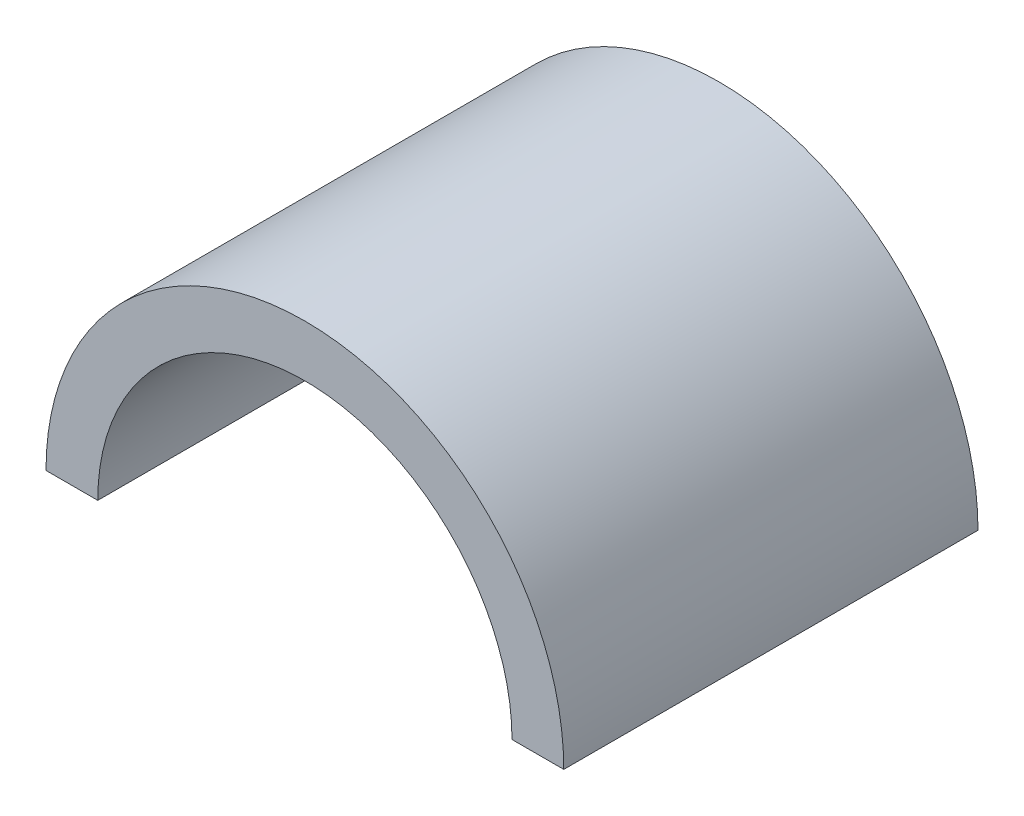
ISO-10303-21;
HEADER;
FILE_DESCRIPTION(('STEP AP214'),'2;1');
FILE_NAME('part.step','',(''),(''),'','','');
FILE_SCHEMA(('AUTOMOTIVE_DESIGN { 1 0 10303 214 1 1 1 1 }'));
ENDSEC;
DATA;
#1=APPLICATION_CONTEXT('core data for automotive mechanical design processes');
#2=APPLICATION_PROTOCOL_DEFINITION('international standard','automotive_design',2000,#1);
#3=PRODUCT_CONTEXT('',#1,'mechanical');
#4=PRODUCT('Part','Part','',(#3));
#5=PRODUCT_RELATED_PRODUCT_CATEGORY('part','',(#4));
#6=PRODUCT_DEFINITION_FORMATION('','',#4);
#7=PRODUCT_DEFINITION_CONTEXT('part definition',#1,'design');
#8=PRODUCT_DEFINITION('design','',#6,#7);
#9=PRODUCT_DEFINITION_SHAPE('','',#8);
#10=(LENGTH_UNIT() NAMED_UNIT(*) SI_UNIT(.MILLI.,.METRE.));
#11=(NAMED_UNIT(*) PLANE_ANGLE_UNIT() SI_UNIT($,.RADIAN.));
#12=(NAMED_UNIT(*) SI_UNIT($,.STERADIAN.) SOLID_ANGLE_UNIT());
#13=UNCERTAINTY_MEASURE_WITH_UNIT(LENGTH_MEASURE(1.E-05),#10,'distance_accuracy_value','');
#14=(GEOMETRIC_REPRESENTATION_CONTEXT(3) GLOBAL_UNCERTAINTY_ASSIGNED_CONTEXT((#13)) GLOBAL_UNIT_ASSIGNED_CONTEXT((#10,
#11,#12)) REPRESENTATION_CONTEXT('',''));
#15=CARTESIAN_POINT('',(0.,0.,0.));
#16=DIRECTION('',(0.,0.,1.));
#17=DIRECTION('',(1.,0.,0.));
#18=AXIS2_PLACEMENT_3D('',#15,#16,#17);
#19=CARTESIAN_POINT('',(0.,0.,40.));
#20=DIRECTION('',(0.,0.,-1.));
#21=DIRECTION('',(-1.,0.,0.));
#22=AXIS2_PLACEMENT_3D('',#19,#20,#21);
#23=CYLINDRICAL_SURFACE('',#22,50.);
#24=CARTESIAN_POINT('',(0.,0.,-40.));
#25=DIRECTION('',(0.,0.,1.));
#26=DIRECTION('',(-1.,0.,0.));
#27=AXIS2_PLACEMENT_3D('',#24,#25,#26);
#28=CIRCLE('',#27,50.);
#29=CARTESIAN_POINT('',(50.,0.,-40.));
#30=VERTEX_POINT('',#29);
#31=CARTESIAN_POINT('',(-50.,0.,-40.));
#32=VERTEX_POINT('',#31);
#33=EDGE_CURVE('E94',#30,#32,#28,.T.);
#34=ORIENTED_EDGE('',*,*,#33,.T.);
#35=DIRECTION('',(0.,0.,-1.));
#36=VECTOR('',#35,1.);
#37=CARTESIAN_POINT('',(-50.,0.,40.));
#38=LINE('',#37,#36);
#39=CARTESIAN_POINT('',(-50.,0.,40.));
#40=VERTEX_POINT('',#39);
#41=EDGE_CURVE('E11',#40,#32,#38,.T.);
#42=ORIENTED_EDGE('',*,*,#41,.F.);
#43=CARTESIAN_POINT('',(0.,0.,40.));
#44=DIRECTION('',(0.,0.,1.));
#45=DIRECTION('',(-1.,0.,0.));
#46=AXIS2_PLACEMENT_3D('',#43,#44,#45);
#47=CIRCLE('',#46,50.);
#48=CARTESIAN_POINT('',(50.,0.,40.));
#49=VERTEX_POINT('',#48);
#50=EDGE_CURVE('E82',#49,#40,#47,.T.);
#51=ORIENTED_EDGE('',*,*,#50,.F.);
#52=DIRECTION('',(0.,0.,-1.));
#53=VECTOR('',#52,1.);
#54=CARTESIAN_POINT('',(50.,0.,40.));
#55=LINE('',#54,#53);
#56=EDGE_CURVE('E90',#49,#30,#55,.T.);
#57=ORIENTED_EDGE('',*,*,#56,.T.);
#58=EDGE_LOOP('',(#34,#42,#51,#57));
#59=FACE_BOUND('',#58,.T.);
#60=ADVANCED_FACE('F31',(#59),#23,.T.);
#61=CARTESIAN_POINT('',(-40.,0.,40.));
#62=DIRECTION('',(0.,1.,0.));
#63=DIRECTION('',(0.,0.,1.));
#64=AXIS2_PLACEMENT_3D('',#61,#62,#63);
#65=PLANE('',#64);
#66=DIRECTION('',(1.,0.,0.));
#67=VECTOR('',#66,1.);
#68=CARTESIAN_POINT('',(-40.,0.,-40.));
#69=LINE('',#68,#67);
#70=CARTESIAN_POINT('',(-40.,0.,-40.));
#71=VERTEX_POINT('',#70);
#72=EDGE_CURVE('E86',#32,#71,#69,.T.);
#73=ORIENTED_EDGE('',*,*,#72,.T.);
#74=DIRECTION('',(0.,0.,-1.));
#75=VECTOR('',#74,1.);
#76=CARTESIAN_POINT('',(-40.,0.,40.));
#77=LINE('',#76,#75);
#78=CARTESIAN_POINT('',(-40.,0.,40.));
#79=VERTEX_POINT('',#78);
#80=EDGE_CURVE('E39',#79,#71,#77,.T.);
#81=ORIENTED_EDGE('',*,*,#80,.F.);
#82=DIRECTION('',(1.,0.,0.));
#83=VECTOR('',#82,1.);
#84=CARTESIAN_POINT('',(-40.,0.,40.));
#85=LINE('',#84,#83);
#86=EDGE_CURVE('E77',#40,#79,#85,.T.);
#87=ORIENTED_EDGE('',*,*,#86,.F.);
#88=ORIENTED_EDGE('',*,*,#41,.T.);
#89=EDGE_LOOP('',(#73,#81,#87,#88));
#90=FACE_BOUND('',#89,.T.);
#91=ADVANCED_FACE('F85',(#90),#65,.F.);
#92=CARTESIAN_POINT('',(0.,0.,40.));
#93=DIRECTION('',(0.,0.,-1.));
#94=DIRECTION('',(-1.,0.,0.));
#95=AXIS2_PLACEMENT_3D('',#92,#93,#94);
#96=CYLINDRICAL_SURFACE('',#95,40.);
#97=CARTESIAN_POINT('',(0.,0.,-40.));
#98=DIRECTION('',(0.,0.,-1.));
#99=DIRECTION('',(-1.,0.,0.));
#100=AXIS2_PLACEMENT_3D('',#97,#98,#99);
#101=CIRCLE('',#100,40.);
#102=CARTESIAN_POINT('',(40.,0.,-40.));
#103=VERTEX_POINT('',#102);
#104=EDGE_CURVE('E64',#71,#103,#101,.T.);
#105=ORIENTED_EDGE('',*,*,#104,.T.);
#106=DIRECTION('',(0.,0.,-1.));
#107=VECTOR('',#106,1.);
#108=CARTESIAN_POINT('',(40.,0.,40.));
#109=LINE('',#108,#107);
#110=CARTESIAN_POINT('',(40.,0.,40.));
#111=VERTEX_POINT('',#110);
#112=EDGE_CURVE('E87',#111,#103,#109,.T.);
#113=ORIENTED_EDGE('',*,*,#112,.F.);
#114=CARTESIAN_POINT('',(0.,0.,40.));
#115=DIRECTION('',(0.,0.,-1.));
#116=DIRECTION('',(-1.,0.,0.));
#117=AXIS2_PLACEMENT_3D('',#114,#115,#116);
#118=CIRCLE('',#117,40.);
#119=EDGE_CURVE('E80',#79,#111,#118,.T.);
#120=ORIENTED_EDGE('',*,*,#119,.F.);
#121=ORIENTED_EDGE('',*,*,#80,.T.);
#122=EDGE_LOOP('',(#105,#113,#120,#121));
#123=FACE_BOUND('',#122,.T.);
#124=ADVANCED_FACE('F88',(#123),#96,.F.);
#125=CARTESIAN_POINT('',(50.,0.,40.));
#126=DIRECTION('',(0.,1.,0.));
#127=DIRECTION('',(0.,0.,1.));
#128=AXIS2_PLACEMENT_3D('',#125,#126,#127);
#129=PLANE('',#128);
#130=DIRECTION('',(1.,0.,0.));
#131=VECTOR('',#130,1.);
#132=CARTESIAN_POINT('',(50.,0.,-40.));
#133=LINE('',#132,#131);
#134=EDGE_CURVE('E70',#103,#30,#133,.T.);
#135=ORIENTED_EDGE('',*,*,#134,.T.);
#136=ORIENTED_EDGE('',*,*,#56,.F.);
#137=DIRECTION('',(1.,0.,0.));
#138=VECTOR('',#137,1.);
#139=CARTESIAN_POINT('',(50.,0.,40.));
#140=LINE('',#139,#138);
#141=EDGE_CURVE('E47',#111,#49,#140,.T.);
#142=ORIENTED_EDGE('',*,*,#141,.F.);
#143=ORIENTED_EDGE('',*,*,#112,.T.);
#144=EDGE_LOOP('',(#135,#136,#142,#143));
#145=FACE_BOUND('',#144,.T.);
#146=ADVANCED_FACE('F101',(#145),#129,.F.);
#147=CARTESIAN_POINT('',(0.,0.,40.));
#148=DIRECTION('',(0.,0.,-1.));
#149=DIRECTION('',(-1.,0.,0.));
#150=AXIS2_PLACEMENT_3D('',#147,#148,#149);
#151=PLANE('',#150);
#152=ORIENTED_EDGE('',*,*,#50,.T.);
#153=ORIENTED_EDGE('',*,*,#86,.T.);
#154=ORIENTED_EDGE('',*,*,#119,.T.);
#155=ORIENTED_EDGE('',*,*,#141,.T.);
#156=EDGE_LOOP('',(#152,#153,#154,#155));
#157=FACE_BOUND('',#156,.T.);
#158=ADVANCED_FACE('F78',(#157),#151,.F.);
#159=CARTESIAN_POINT('',(0.,0.,-40.));
#160=DIRECTION('',(0.,0.,-1.));
#161=DIRECTION('',(-1.,0.,0.));
#162=AXIS2_PLACEMENT_3D('',#159,#160,#161);
#163=PLANE('',#162);
#164=ORIENTED_EDGE('',*,*,#33,.F.);
#165=ORIENTED_EDGE('',*,*,#134,.F.);
#166=ORIENTED_EDGE('',*,*,#104,.F.);
#167=ORIENTED_EDGE('',*,*,#72,.F.);
#168=EDGE_LOOP('',(#164,#165,#166,#167));
#169=FACE_BOUND('',#168,.T.);
#170=ADVANCED_FACE('F104',(#169),#163,.T.);
#171=CLOSED_SHELL('',(#60,#91,#124,#146,#158,#170));
#172=MANIFOLD_SOLID_BREP('B2',#171);
#173=ADVANCED_BREP_SHAPE_REPRESENTATION('',(#18,#172),#14);
#174=SHAPE_DEFINITION_REPRESENTATION(#9,#173);
ENDSEC;
END-ISO-10303-21;
